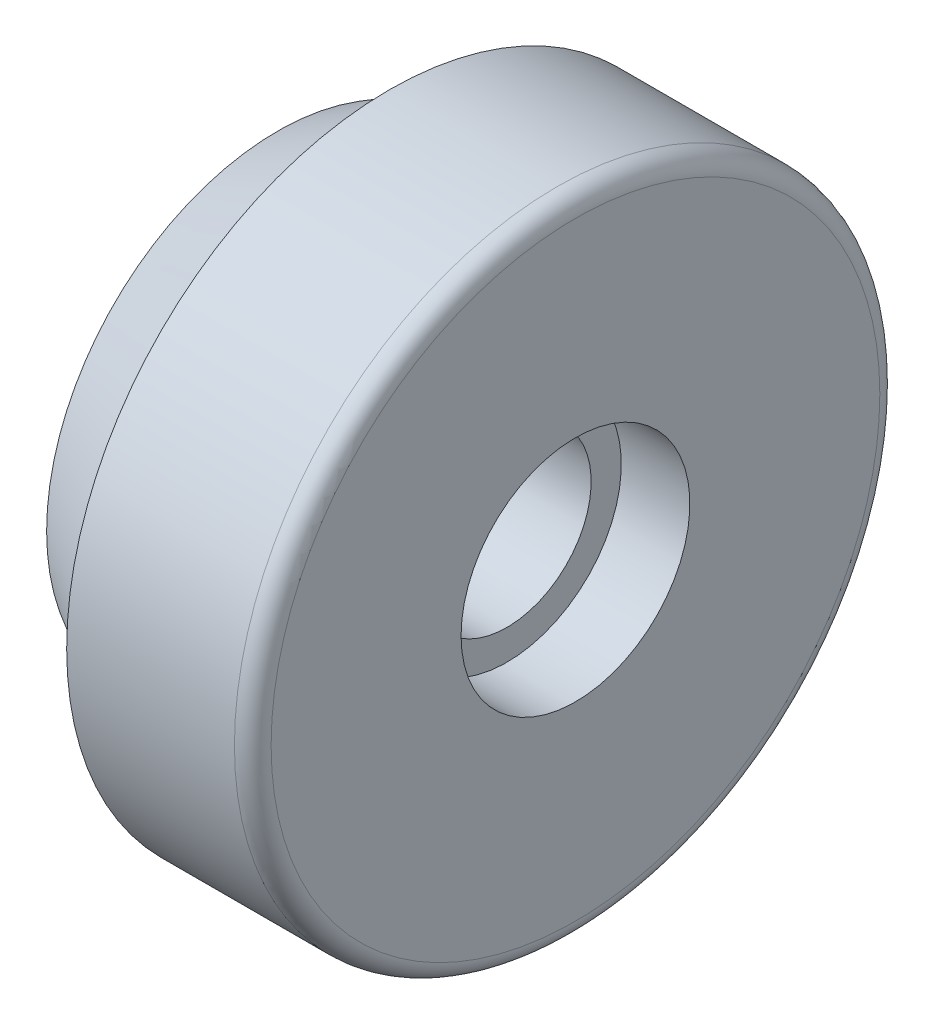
ISO-10303-21;
HEADER;
FILE_DESCRIPTION(('STEP AP214'),'2;1');
FILE_NAME('part.step','',(''),(''),'','','');
FILE_SCHEMA(('AUTOMOTIVE_DESIGN { 1 0 10303 214 1 1 1 1 }'));
ENDSEC;
DATA;
#1=APPLICATION_CONTEXT('core data for automotive mechanical design processes');
#2=APPLICATION_PROTOCOL_DEFINITION('international standard','automotive_design',2000,#1);
#3=PRODUCT_CONTEXT('',#1,'mechanical');
#4=PRODUCT('Part','Part','',(#3));
#5=PRODUCT_RELATED_PRODUCT_CATEGORY('part','',(#4));
#6=PRODUCT_DEFINITION_FORMATION('','',#4);
#7=PRODUCT_DEFINITION_CONTEXT('part definition',#1,'design');
#8=PRODUCT_DEFINITION('design','',#6,#7);
#9=PRODUCT_DEFINITION_SHAPE('','',#8);
#10=(LENGTH_UNIT() NAMED_UNIT(*) SI_UNIT(.MILLI.,.METRE.));
#11=(NAMED_UNIT(*) PLANE_ANGLE_UNIT() SI_UNIT($,.RADIAN.));
#12=(NAMED_UNIT(*) SI_UNIT($,.STERADIAN.) SOLID_ANGLE_UNIT());
#13=UNCERTAINTY_MEASURE_WITH_UNIT(LENGTH_MEASURE(1.E-05),#10,'distance_accuracy_value','');
#14=(GEOMETRIC_REPRESENTATION_CONTEXT(3) GLOBAL_UNCERTAINTY_ASSIGNED_CONTEXT((#13)) GLOBAL_UNIT_ASSIGNED_CONTEXT((#10,
#11,#12)) REPRESENTATION_CONTEXT('',''));
#15=CARTESIAN_POINT('',(0.,0.,0.));
#16=DIRECTION('',(0.,0.,1.));
#17=DIRECTION('',(1.,0.,0.));
#18=AXIS2_PLACEMENT_3D('',#15,#16,#17);
#19=CARTESIAN_POINT('',(-17.4625,0.,0.));
#20=DIRECTION('',(-1.,0.,0.));
#21=DIRECTION('',(0.,0.,1.));
#22=AXIS2_PLACEMENT_3D('',#19,#20,#21);
#23=TOROIDAL_SURFACE('',#22,52.705,3.175);
#24=CARTESIAN_POINT('',(-17.4625,0.,0.));
#25=DIRECTION('',(-1.,0.,0.));
#26=DIRECTION('',(0.,0.,1.));
#27=AXIS2_PLACEMENT_3D('',#24,#25,#26);
#28=CIRCLE('',#27,55.88);
#29=CARTESIAN_POINT('',(-17.4625,0.,55.88));
#30=VERTEX_POINT('',#29);
#31=EDGE_CURVE('E10',#30,#30,#28,.T.);
#32=ORIENTED_EDGE('',*,*,#31,.F.);
#33=EDGE_LOOP('',(#32));
#34=FACE_BOUND('',#33,.T.);
#35=CARTESIAN_POINT('',(-14.2875,0.,0.));
#36=DIRECTION('',(-1.,0.,0.));
#37=DIRECTION('',(0.,0.,1.));
#38=AXIS2_PLACEMENT_3D('',#35,#36,#37);
#39=CIRCLE('',#38,52.705);
#40=CARTESIAN_POINT('',(-14.2875,0.,52.705));
#41=VERTEX_POINT('',#40);
#42=EDGE_CURVE('E63',#41,#41,#39,.T.);
#43=ORIENTED_EDGE('',*,*,#42,.T.);
#44=EDGE_LOOP('',(#43));
#45=FACE_BOUND('',#44,.T.);
#46=ADVANCED_FACE('F32',(#34,#45),#23,.T.);
#47=CARTESIAN_POINT('',(0.,0.,0.));
#48=DIRECTION('',(-1.,0.,0.));
#49=DIRECTION('',(0.,0.,1.));
#50=AXIS2_PLACEMENT_3D('',#47,#48,#49);
#51=CYLINDRICAL_SURFACE('',#50,55.88);
#52=CARTESIAN_POINT('',(-46.51375,0.,0.));
#53=DIRECTION('',(-1.,0.,0.));
#54=DIRECTION('',(0.,0.,1.));
#55=AXIS2_PLACEMENT_3D('',#52,#53,#54);
#56=CIRCLE('',#55,55.88);
#57=CARTESIAN_POINT('',(-46.51375,0.,55.88));
#58=VERTEX_POINT('',#57);
#59=EDGE_CURVE('E38',#58,#58,#56,.T.);
#60=ORIENTED_EDGE('',*,*,#59,.F.);
#61=EDGE_LOOP('',(#60));
#62=FACE_BOUND('',#61,.T.);
#63=ORIENTED_EDGE('',*,*,#31,.T.);
#64=EDGE_LOOP('',(#63));
#65=FACE_BOUND('',#64,.T.);
#66=ADVANCED_FACE('F103',(#62,#65),#51,.T.);
#67=CARTESIAN_POINT('',(-46.51375,55.88,0.));
#68=DIRECTION('',(1.,0.,0.));
#69=DIRECTION('',(0.,0.,-1.));
#70=AXIS2_PLACEMENT_3D('',#67,#68,#69);
#71=PLANE('',#70);
#72=CARTESIAN_POINT('',(-46.51375,0.,0.));
#73=DIRECTION('',(-1.,0.,0.));
#74=DIRECTION('',(0.,0.,1.));
#75=AXIS2_PLACEMENT_3D('',#72,#73,#74);
#76=CIRCLE('',#75,51.1666174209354);
#77=CARTESIAN_POINT('',(-46.51375,0.,51.1666174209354));
#78=VERTEX_POINT('',#77);
#79=EDGE_CURVE('E42',#78,#78,#76,.T.);
#80=ORIENTED_EDGE('',*,*,#79,.F.);
#81=EDGE_LOOP('',(#80));
#82=FACE_BOUND('',#81,.T.);
#83=ORIENTED_EDGE('',*,*,#59,.T.);
#84=EDGE_LOOP('',(#83));
#85=FACE_BOUND('',#84,.T.);
#86=ADVANCED_FACE('F108',(#82,#85),#71,.F.);
#87=CARTESIAN_POINT('',(-46.51375,0.,0.));
#88=DIRECTION('',(1.,0.,0.));
#89=DIRECTION('',(0.,0.,-1.));
#90=AXIS2_PLACEMENT_3D('',#87,#88,#89);
#91=CONICAL_SURFACE('',#90,51.1666174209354,0.523598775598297);
#92=CARTESIAN_POINT('',(-65.88125,0.,0.));
#93=DIRECTION('',(-1.,0.,0.));
#94=DIRECTION('',(0.,0.,1.));
#95=AXIS2_PLACEMENT_3D('',#92,#93,#94);
#96=CIRCLE('',#95,39.9847860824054);
#97=CARTESIAN_POINT('',(-65.88125,0.,39.9847860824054));
#98=VERTEX_POINT('',#97);
#99=EDGE_CURVE('E46',#98,#98,#96,.T.);
#100=ORIENTED_EDGE('',*,*,#99,.F.);
#101=EDGE_LOOP('',(#100));
#102=FACE_BOUND('',#101,.T.);
#103=ORIENTED_EDGE('',*,*,#79,.T.);
#104=EDGE_LOOP('',(#103));
#105=FACE_BOUND('',#104,.T.);
#106=ADVANCED_FACE('F99',(#102,#105),#91,.T.);
#107=CARTESIAN_POINT('',(-65.88125,39.9847860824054,0.));
#108=DIRECTION('',(1.,0.,0.));
#109=DIRECTION('',(0.,0.,-1.));
#110=AXIS2_PLACEMENT_3D('',#107,#108,#109);
#111=PLANE('',#110);
#112=ORIENTED_EDGE('',*,*,#99,.T.);
#113=EDGE_LOOP('',(#112));
#114=FACE_BOUND('',#113,.T.);
#115=ADVANCED_FACE('F94',(#114),#111,.F.);
#116=CARTESIAN_POINT('',(-49.4355110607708,14.592747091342,0.));
#117=DIRECTION('',(-1.,0.,0.));
#118=DIRECTION('',(0.,0.,1.));
#119=AXIS2_PLACEMENT_3D('',#116,#117,#118);
#120=PLANE('',#119);
#121=CARTESIAN_POINT('',(-49.4355110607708,0.,0.));
#122=DIRECTION('',(-1.,0.,0.));
#123=DIRECTION('',(0.,0.,1.));
#124=AXIS2_PLACEMENT_3D('',#121,#122,#123);
#125=CIRCLE('',#124,14.592747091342);
#126=CARTESIAN_POINT('',(-49.4355110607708,0.,14.592747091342));
#127=VERTEX_POINT('',#126);
#128=EDGE_CURVE('E51',#127,#127,#125,.T.);
#129=ORIENTED_EDGE('',*,*,#128,.F.);
#130=EDGE_LOOP('',(#129));
#131=FACE_BOUND('',#130,.T.);
#132=ADVANCED_FACE('F89',(#131),#120,.F.);
#133=CARTESIAN_POINT('',(0.,0.,0.));
#134=DIRECTION('',(-1.,0.,0.));
#135=DIRECTION('',(0.,0.,1.));
#136=AXIS2_PLACEMENT_3D('',#133,#134,#135);
#137=CYLINDRICAL_SURFACE('',#136,14.592747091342);
#138=CARTESIAN_POINT('',(-26.162,0.,0.));
#139=DIRECTION('',(-1.,0.,0.));
#140=DIRECTION('',(0.,0.,1.));
#141=AXIS2_PLACEMENT_3D('',#138,#139,#140);
#142=CIRCLE('',#141,14.592747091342);
#143=CARTESIAN_POINT('',(-26.162,0.,14.592747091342));
#144=VERTEX_POINT('',#143);
#145=EDGE_CURVE('E54',#144,#144,#142,.T.);
#146=ORIENTED_EDGE('',*,*,#145,.F.);
#147=EDGE_LOOP('',(#146));
#148=FACE_BOUND('',#147,.T.);
#149=ORIENTED_EDGE('',*,*,#128,.T.);
#150=EDGE_LOOP('',(#149));
#151=FACE_BOUND('',#150,.T.);
#152=ADVANCED_FACE('F83',(#148,#151),#137,.F.);
#153=CARTESIAN_POINT('',(-26.162,19.812,0.));
#154=DIRECTION('',(-1.,0.,0.));
#155=DIRECTION('',(0.,0.,1.));
#156=AXIS2_PLACEMENT_3D('',#153,#154,#155);
#157=PLANE('',#156);
#158=CARTESIAN_POINT('',(-26.162,0.,0.));
#159=DIRECTION('',(-1.,0.,0.));
#160=DIRECTION('',(0.,0.,1.));
#161=AXIS2_PLACEMENT_3D('',#158,#159,#160);
#162=CIRCLE('',#161,19.812);
#163=CARTESIAN_POINT('',(-26.162,0.,19.812));
#164=VERTEX_POINT('',#163);
#165=EDGE_CURVE('E57',#164,#164,#162,.T.);
#166=ORIENTED_EDGE('',*,*,#165,.F.);
#167=EDGE_LOOP('',(#166));
#168=FACE_BOUND('',#167,.T.);
#169=ORIENTED_EDGE('',*,*,#145,.T.);
#170=EDGE_LOOP('',(#169));
#171=FACE_BOUND('',#170,.T.);
#172=ADVANCED_FACE('F77',(#168,#171),#157,.F.);
#173=CARTESIAN_POINT('',(0.,0.,0.));
#174=DIRECTION('',(-1.,0.,0.));
#175=DIRECTION('',(0.,0.,1.));
#176=AXIS2_PLACEMENT_3D('',#173,#174,#175);
#177=CYLINDRICAL_SURFACE('',#176,19.812);
#178=CARTESIAN_POINT('',(-14.2875,0.,0.));
#179=DIRECTION('',(-1.,0.,0.));
#180=DIRECTION('',(0.,0.,1.));
#181=AXIS2_PLACEMENT_3D('',#178,#179,#180);
#182=CIRCLE('',#181,19.812);
#183=CARTESIAN_POINT('',(-14.2875,0.,19.812));
#184=VERTEX_POINT('',#183);
#185=EDGE_CURVE('E60',#184,#184,#182,.T.);
#186=ORIENTED_EDGE('',*,*,#185,.F.);
#187=EDGE_LOOP('',(#186));
#188=FACE_BOUND('',#187,.T.);
#189=ORIENTED_EDGE('',*,*,#165,.T.);
#190=EDGE_LOOP('',(#189));
#191=FACE_BOUND('',#190,.T.);
#192=ADVANCED_FACE('F71',(#188,#191),#177,.F.);
#193=CARTESIAN_POINT('',(-14.2875,52.705,0.));
#194=DIRECTION('',(-1.,0.,0.));
#195=DIRECTION('',(0.,0.,1.));
#196=AXIS2_PLACEMENT_3D('',#193,#194,#195);
#197=PLANE('',#196);
#198=ORIENTED_EDGE('',*,*,#42,.F.);
#199=EDGE_LOOP('',(#198));
#200=FACE_BOUND('',#199,.T.);
#201=ORIENTED_EDGE('',*,*,#185,.T.);
#202=EDGE_LOOP('',(#201));
#203=FACE_BOUND('',#202,.T.);
#204=ADVANCED_FACE('F68',(#200,#203),#197,.F.);
#205=CLOSED_SHELL('',(#46,#66,#86,#106,#115,#132,#152,#172,#192,#204));
#206=MANIFOLD_SOLID_BREP('B2',#205);
#207=ADVANCED_BREP_SHAPE_REPRESENTATION('',(#18,#206),#14);
#208=SHAPE_DEFINITION_REPRESENTATION(#9,#207);
ENDSEC;
END-ISO-10303-21;
